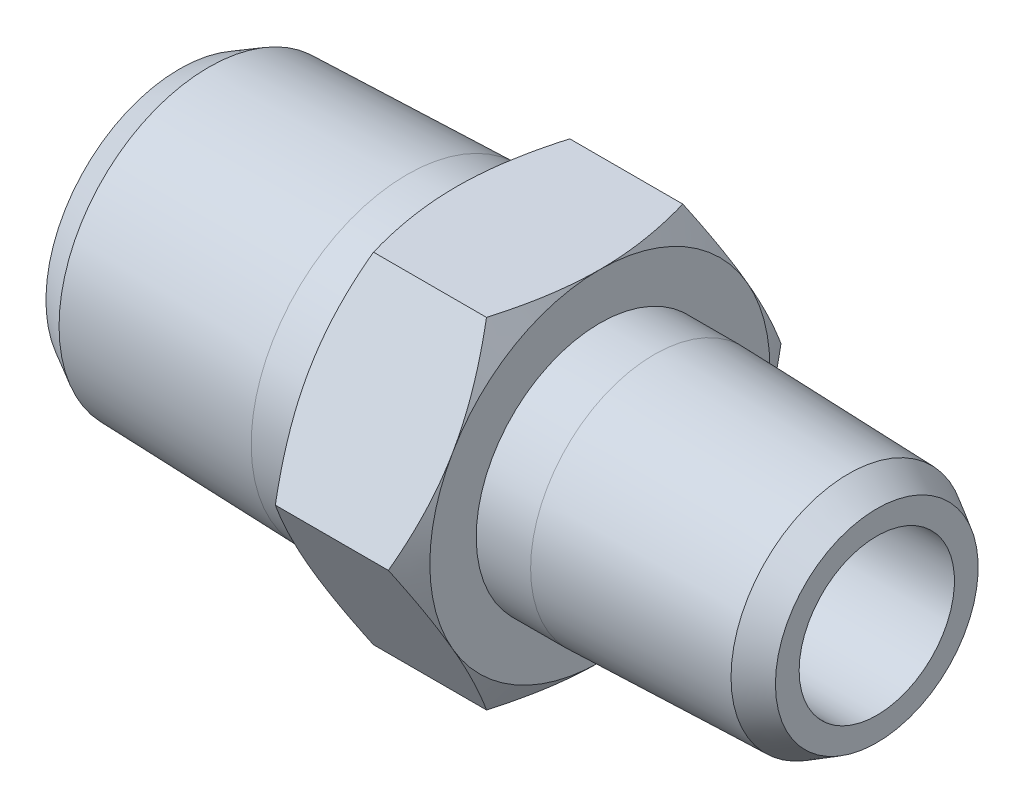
ISO-10303-21;
HEADER;
FILE_DESCRIPTION(('STEP AP214'),'2;1');
FILE_NAME('part.step','',(''),(''),'','','');
FILE_SCHEMA(('AUTOMOTIVE_DESIGN { 1 0 10303 214 1 1 1 1 }'));
ENDSEC;
DATA;
#1=APPLICATION_CONTEXT('core data for automotive mechanical design processes');
#2=APPLICATION_PROTOCOL_DEFINITION('international standard','automotive_design',2000,#1);
#3=PRODUCT_CONTEXT('',#1,'mechanical');
#4=PRODUCT('Part','Part','',(#3));
#5=PRODUCT_RELATED_PRODUCT_CATEGORY('part','',(#4));
#6=PRODUCT_DEFINITION_FORMATION('','',#4);
#7=PRODUCT_DEFINITION_CONTEXT('part definition',#1,'design');
#8=PRODUCT_DEFINITION('design','',#6,#7);
#9=PRODUCT_DEFINITION_SHAPE('','',#8);
#10=(LENGTH_UNIT() NAMED_UNIT(*) SI_UNIT(.MILLI.,.METRE.));
#11=(NAMED_UNIT(*) PLANE_ANGLE_UNIT() SI_UNIT($,.RADIAN.));
#12=(NAMED_UNIT(*) SI_UNIT($,.STERADIAN.) SOLID_ANGLE_UNIT());
#13=UNCERTAINTY_MEASURE_WITH_UNIT(LENGTH_MEASURE(1.E-05),#10,'distance_accuracy_value','');
#14=(GEOMETRIC_REPRESENTATION_CONTEXT(3) GLOBAL_UNCERTAINTY_ASSIGNED_CONTEXT((#13)) GLOBAL_UNIT_ASSIGNED_CONTEXT((#10,
#11,#12)) REPRESENTATION_CONTEXT('',''));
#15=CARTESIAN_POINT('',(0.,0.,0.));
#16=DIRECTION('',(0.,0.,1.));
#17=DIRECTION('',(1.,0.,0.));
#18=AXIS2_PLACEMENT_3D('',#15,#16,#17);
#19=CARTESIAN_POINT('',(6.58147714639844,0.,0.));
#20=DIRECTION('',(-1.,0.,0.));
#21=DIRECTION('',(0.,0.,1.));
#22=AXIS2_PLACEMENT_3D('',#19,#20,#21);
#23=CONICAL_SURFACE('',#22,10.0900834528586,1.04719755);
#24=CARTESIAN_POINT('',(7.36600000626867,0.,0.));
#25=DIRECTION('',(-1.,0.,0.));
#26=DIRECTION('',(0.,0.,1.));
#27=AXIS2_PLACEMENT_3D('',#24,#25,#26);
#28=CIRCLE('',#27,8.73125000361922);
#29=CARTESIAN_POINT('',(7.36600000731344,-4.3656250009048,-7.56148430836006));
#30=VERTEX_POINT('',#29);
#31=CARTESIAN_POINT('',(7.36600000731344,4.3656250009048,-7.56148430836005));
#32=VERTEX_POINT('',#31);
#33=EDGE_CURVE('E110',#30,#32,#28,.F.);
#34=ORIENTED_EDGE('',*,*,#33,.F.);
#35=CARTESIAN_POINT('',(6.58615620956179,1.83149545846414E-09,-10.0819790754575));
#36=CARTESIAN_POINT('',(6.70463926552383,-0.355360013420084,-9.87681187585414));
#37=CARTESIAN_POINT('',(6.8131904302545,-0.713565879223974,-9.67000162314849));
#38=CARTESIAN_POINT('',(7.00461845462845,-1.43313515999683,-9.2545581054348));
#39=CARTESIAN_POINT('',(7.08762226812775,-1.79447347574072,-9.04593933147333));
#40=CARTESIAN_POINT('',(7.18953685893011,-2.33989110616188,-8.73104231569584));
#41=CARTESIAN_POINT('',(7.21975557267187,-2.52238596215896,-8.62567886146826));
#42=CARTESIAN_POINT('',(7.27206479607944,-2.88824935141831,-8.41444753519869));
#43=CARTESIAN_POINT('',(7.29415551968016,-3.07161786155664,-8.30857967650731));
#44=CARTESIAN_POINT('',(7.32982062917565,-3.43990681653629,-8.09594794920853));
#45=CARTESIAN_POINT('',(7.34335170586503,-3.62483043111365,-7.9891822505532));
#46=CARTESIAN_POINT('',(7.36146012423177,-3.99504134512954,-7.77544087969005));
#47=CARTESIAN_POINT('',(7.36603569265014,-4.18032870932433,-7.66846517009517));
#48=CARTESIAN_POINT('',(7.36600000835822,-4.3656249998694,-7.56148430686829));
#49=B_SPLINE_CURVE_WITH_KNOTS('',3,(#35,#36,#37,#38,#39,#40,#41,#42,#43,#44,#45,#46,#47,#48),
.UNSPECIFIED.,.F.,.F.,(4,2,2,2,2,2,4),(0.,1.28181151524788,2.55714639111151,3.19565058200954,
3.83413796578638,4.47583059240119,5.11765026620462),.UNSPECIFIED.);
#50=CARTESIAN_POINT('',(6.5861562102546,0.,-10.0819790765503));
#51=VERTEX_POINT('',#50);
#52=EDGE_CURVE('E123',#51,#30,#49,.T.);
#53=ORIENTED_EDGE('',*,*,#52,.F.);
#54=CARTESIAN_POINT('',(7.36600000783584,4.3656249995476,-7.5614843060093));
#55=CARTESIAN_POINT('',(7.3660356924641,4.18032870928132,-7.668465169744));
#56=CARTESIAN_POINT('',(7.36146012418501,3.99504134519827,-7.77544087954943));
#57=CARTESIAN_POINT('',(7.34335170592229,3.62483043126,-7.98918225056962));
#58=CARTESIAN_POINT('',(7.32982062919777,3.43990681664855,-8.09594794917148));
#59=CARTESIAN_POINT('',(7.29415551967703,3.07161786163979,-8.30857967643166));
#60=CARTESIAN_POINT('',(7.272064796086,2.88824935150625,-8.41444753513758));
#61=CARTESIAN_POINT('',(7.21975557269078,2.52238596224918,-8.62567886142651));
#62=CARTESIAN_POINT('',(7.18953685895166,2.33989110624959,-8.73104231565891));
#63=CARTESIAN_POINT('',(7.0876222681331,1.79447347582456,-9.04593933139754));
#64=CARTESIAN_POINT('',(7.00461845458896,1.43313516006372,-9.25455810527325));
#65=CARTESIAN_POINT('',(6.8131904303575,0.713565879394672,-9.67000162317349));
#66=CARTESIAN_POINT('',(6.70463926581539,0.355360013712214,-9.87681187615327));
#67=CARTESIAN_POINT('',(6.58615621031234,-1.25830554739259E-09,-10.0819790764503));
#68=B_SPLINE_CURVE_WITH_KNOTS('',3,(#54,#55,#56,#57,#58,#59,#60,#61,#62,#63,#64,#65,#66,#67),
.UNSPECIFIED.,.F.,.F.,(4,2,2,2,2,2,4),(0.,0.641819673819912,1.28351230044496,1.92199968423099,
2.5605038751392,3.83583875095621,5.11765026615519),.UNSPECIFIED.);
#69=EDGE_CURVE('E132',#32,#51,#68,.T.);
#70=ORIENTED_EDGE('',*,*,#69,.F.);
#71=EDGE_LOOP('',(#34,#53,#70));
#72=FACE_BOUND('',#71,.T.);
#73=ADVANCED_FACE('F17',(#72),#23,.T.);
#74=CARTESIAN_POINT('',(6.58147714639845,0.,0.));
#75=DIRECTION('',(-1.,0.,0.));
#76=DIRECTION('',(0.,0.,1.));
#77=AXIS2_PLACEMENT_3D('',#74,#75,#76);
#78=CONICAL_SURFACE('',#77,10.0900834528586,1.04719755);
#79=CARTESIAN_POINT('',(7.36600000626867,0.,0.));
#80=DIRECTION('',(-1.,0.,0.));
#81=DIRECTION('',(0.,0.,1.));
#82=AXIS2_PLACEMENT_3D('',#79,#80,#81);
#83=CIRCLE('',#82,8.73125000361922);
#84=CARTESIAN_POINT('',(7.36600000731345,8.73125000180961,0.));
#85=VERTEX_POINT('',#84);
#86=EDGE_CURVE('E134',#32,#85,#83,.F.);
#87=ORIENTED_EDGE('',*,*,#86,.F.);
#88=CARTESIAN_POINT('',(6.58615620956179,8.73125000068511,-5.04098953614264));
#89=CARTESIAN_POINT('',(6.70463926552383,8.37588998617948,-5.24615673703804));
#90=CARTESIAN_POINT('',(6.81319043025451,8.01768412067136,-5.45296699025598));
#91=CARTESIAN_POINT('',(7.00461845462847,7.29811484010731,-5.86841050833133));
#92=CARTESIAN_POINT('',(7.08762226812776,6.93677652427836,-6.07702928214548));
#93=CARTESIAN_POINT('',(7.18953685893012,6.39135889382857,-6.39192629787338));
#94=CARTESIAN_POINT('',(7.21975557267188,6.20886403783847,-6.49728975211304));
#95=CARTESIAN_POINT('',(7.27206479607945,5.84300064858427,-6.70852107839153));
#96=CARTESIAN_POINT('',(7.29415551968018,5.6596321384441,-6.81438893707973));
#97=CARTESIAN_POINT('',(7.32982062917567,5.29134318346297,-7.02702066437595));
#98=CARTESIAN_POINT('',(7.34335170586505,5.10641956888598,-7.13378636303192));
#99=CARTESIAN_POINT('',(7.36146012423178,4.73620865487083,-7.34752773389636));
#100=CARTESIAN_POINT('',(7.36603569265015,4.55092129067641,-7.45450344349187));
#101=CARTESIAN_POINT('',(7.36600000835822,4.3656250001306,-7.56148430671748));
#102=B_SPLINE_CURVE_WITH_KNOTS('',3,(#88,#89,#90,#91,#92,#93,#94,#95,#96,#97,#98,#99,#100,#101),
.UNSPECIFIED.,.F.,.F.,(4,2,2,2,2,2,4),(0.,1.28181151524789,2.55714639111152,3.19565058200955,
3.83413796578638,4.47583059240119,5.11765026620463),.UNSPECIFIED.);
#103=CARTESIAN_POINT('',(6.5861562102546,8.73125000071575,-5.04098953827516));
#104=VERTEX_POINT('',#103);
#105=EDGE_CURVE('E122',#104,#32,#102,.T.);
#106=ORIENTED_EDGE('',*,*,#105,.F.);
#107=CARTESIAN_POINT('',(7.36600000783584,8.7312499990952,0.));
#108=CARTESIAN_POINT('',(7.36603569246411,8.73124999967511,-0.213961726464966));
#109=CARTESIAN_POINT('',(7.36146012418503,8.73124999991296,-0.427913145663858));
#110=CARTESIAN_POINT('',(7.34335170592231,8.73125000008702,-0.85539588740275));
#111=CARTESIAN_POINT('',(7.32982062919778,8.73125000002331,-1.06892728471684));
#112=CARTESIAN_POINT('',(7.29415551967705,8.73124999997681,-1.49419073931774));
#113=CARTESIAN_POINT('',(7.27206479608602,8.73124999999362,-1.70592645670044));
#114=CARTESIAN_POINT('',(7.21975557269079,8.73125000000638,-2.12838910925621));
#115=CARTESIAN_POINT('',(7.18953685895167,8.73125000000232,-2.33911601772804));
#116=CARTESIAN_POINT('',(7.08762226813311,8.73124999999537,-2.96891004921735));
#117=CARTESIAN_POINT('',(7.00461845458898,8.73124999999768,-3.38614759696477));
#118=CARTESIAN_POINT('',(6.81319043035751,8.73125000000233,-4.21703463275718));
#119=CARTESIAN_POINT('',(6.70463926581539,8.73125000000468,-4.63065513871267));
#120=CARTESIAN_POINT('',(6.58615621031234,8.73125,-5.04098953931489));
#121=B_SPLINE_CURVE_WITH_KNOTS('',3,(#107,#108,#109,#110,#111,#112,#113,#114,#115,#116,#117,
#118,#119,#120),.UNSPECIFIED.,.F.,.F.,(4,2,2,2,2,2,4),(0.,0.641819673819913,1.28351230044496,
1.92199968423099,2.5605038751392,3.83583875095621,5.1176502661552),.UNSPECIFIED.);
#122=EDGE_CURVE('E427',#85,#104,#121,.T.);
#123=ORIENTED_EDGE('',*,*,#122,.F.);
#124=EDGE_LOOP('',(#87,#106,#123));
#125=FACE_BOUND('',#124,.T.);
#126=ADVANCED_FACE('F158',(#125),#78,.T.);
#127=CARTESIAN_POINT('',(6.58147714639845,0.,0.));
#128=DIRECTION('',(-1.,0.,0.));
#129=DIRECTION('',(0.,0.,1.));
#130=AXIS2_PLACEMENT_3D('',#127,#128,#129);
#131=CONICAL_SURFACE('',#130,10.0900834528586,1.04719755);
#132=CARTESIAN_POINT('',(7.36600000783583,4.3656249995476,7.56148430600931));
#133=CARTESIAN_POINT('',(7.3660356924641,4.55092129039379,7.45450344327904));
#134=CARTESIAN_POINT('',(7.36146012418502,4.73620865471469,7.34752773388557));
#135=CARTESIAN_POINT('',(7.34335170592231,5.10641956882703,7.13378636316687));
#136=CARTESIAN_POINT('',(7.32982062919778,5.29134318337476,7.02702066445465));
#137=CARTESIAN_POINT('',(7.29415551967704,5.65963213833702,6.81438893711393));
#138=CARTESIAN_POINT('',(7.27206479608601,5.84300064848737,6.70852107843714));
#139=CARTESIAN_POINT('',(7.21975557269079,6.2088640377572,6.4972897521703));
#140=CARTESIAN_POINT('',(7.18953685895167,6.39135889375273,6.39192629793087));
#141=CARTESIAN_POINT('',(7.08762226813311,6.93677652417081,6.0770292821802));
#142=CARTESIAN_POINT('',(7.00461845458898,7.29811483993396,5.86841050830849));
#143=CARTESIAN_POINT('',(6.81319043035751,8.01768412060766,5.45296699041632));
#144=CARTESIAN_POINT('',(6.70463926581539,8.37588998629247,5.2461567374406));
#145=CARTESIAN_POINT('',(6.58615621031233,8.73125000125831,5.04098953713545));
#146=B_SPLINE_CURVE_WITH_KNOTS('',3,(#132,#133,#134,#135,#136,#137,#138,#139,#140,#141,#142,
#143,#144,#145),.UNSPECIFIED.,.F.,.F.,(4,2,2,2,2,2,4),(0.,0.641819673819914,1.28351230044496,
1.92199968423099,2.5605038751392,3.83583875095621,5.1176502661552),.UNSPECIFIED.);
#147=CARTESIAN_POINT('',(7.36600000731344,4.3656250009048,7.56148430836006));
#148=VERTEX_POINT('',#147);
#149=CARTESIAN_POINT('',(6.5861562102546,8.73125000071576,5.04098953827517));
#150=VERTEX_POINT('',#149);
#151=EDGE_CURVE('E424',#148,#150,#146,.T.);
#152=ORIENTED_EDGE('',*,*,#151,.F.);
#153=CARTESIAN_POINT('',(7.36600000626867,0.,0.));
#154=DIRECTION('',(-1.,0.,0.));
#155=DIRECTION('',(0.,0.,1.));
#156=AXIS2_PLACEMENT_3D('',#153,#154,#155);
#157=CIRCLE('',#156,8.73125000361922);
#158=EDGE_CURVE('E135',#85,#148,#157,.F.);
#159=ORIENTED_EDGE('',*,*,#158,.F.);
#160=CARTESIAN_POINT('',(6.58615620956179,8.73124999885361,5.04098953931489));
#161=CARTESIAN_POINT('',(6.70463926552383,8.73124999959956,4.63065513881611));
#162=CARTESIAN_POINT('',(6.81319043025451,8.73124999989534,4.21703463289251));
#163=CARTESIAN_POINT('',(7.00461845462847,8.73125000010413,3.38614759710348));
#164=CARTESIAN_POINT('',(7.08762226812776,8.73125000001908,2.96891004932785));
#165=CARTESIAN_POINT('',(7.18953685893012,8.73124999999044,2.33911601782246));
#166=CARTESIAN_POINT('',(7.21975557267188,8.73124999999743,2.12838910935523));
#167=CARTESIAN_POINT('',(7.27206479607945,8.73125000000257,1.70592645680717));
#168=CARTESIAN_POINT('',(7.29415551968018,8.73125000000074,1.49419073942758));
#169=CARTESIAN_POINT('',(7.32982062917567,8.73124999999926,1.06892728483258));
#170=CARTESIAN_POINT('',(7.34335170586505,8.73124999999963,0.855395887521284));
#171=CARTESIAN_POINT('',(7.36146012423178,8.73125000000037,0.427913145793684));
#172=CARTESIAN_POINT('',(7.36603569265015,8.73125000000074,0.213961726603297));
#173=CARTESIAN_POINT('',(7.36600000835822,8.73125,1.50800964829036E-10));
#174=B_SPLINE_CURVE_WITH_KNOTS('',3,(#160,#161,#162,#163,#164,#165,#166,#167,#168,#169,#170,
#171,#172,#173),.UNSPECIFIED.,.F.,.F.,(4,2,2,2,2,2,4),(0.,1.28181151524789,2.55714639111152,
3.19565058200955,3.83413796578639,4.4758305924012,5.11765026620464),.UNSPECIFIED.);
#175=EDGE_CURVE('E168',#150,#85,#174,.T.);
#176=ORIENTED_EDGE('',*,*,#175,.F.);
#177=EDGE_LOOP('',(#152,#159,#176));
#178=FACE_BOUND('',#177,.T.);
#179=ADVANCED_FACE('F633',(#178),#131,.T.);
#180=CARTESIAN_POINT('',(6.58147714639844,0.,0.));
#181=DIRECTION('',(-1.,0.,0.));
#182=DIRECTION('',(0.,0.,1.));
#183=AXIS2_PLACEMENT_3D('',#180,#181,#182);
#184=CONICAL_SURFACE('',#183,10.0900834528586,1.04719755);
#185=CARTESIAN_POINT('',(7.36600000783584,-4.3656249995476,7.5614843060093));
#186=CARTESIAN_POINT('',(7.3660356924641,-4.18032870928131,7.668465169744));
#187=CARTESIAN_POINT('',(7.36146012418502,-3.99504134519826,7.77544087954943));
#188=CARTESIAN_POINT('',(7.3433517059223,-3.62483043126,7.98918225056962));
#189=CARTESIAN_POINT('',(7.32982062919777,-3.43990681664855,8.09594794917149));
#190=CARTESIAN_POINT('',(7.29415551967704,-3.07161786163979,8.30857967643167));
#191=CARTESIAN_POINT('',(7.27206479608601,-2.88824935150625,8.41444753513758));
#192=CARTESIAN_POINT('',(7.21975557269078,-2.52238596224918,8.62567886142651));
#193=CARTESIAN_POINT('',(7.18953685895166,-2.33989110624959,8.73104231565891));
#194=CARTESIAN_POINT('',(7.0876222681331,-1.79447347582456,9.04593933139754));
#195=CARTESIAN_POINT('',(7.00461845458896,-1.43313516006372,9.25455810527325));
#196=CARTESIAN_POINT('',(6.8131904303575,-0.713565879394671,9.67000162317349));
#197=CARTESIAN_POINT('',(6.70463926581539,-0.355360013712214,9.87681187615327));
#198=CARTESIAN_POINT('',(6.58615621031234,1.25830591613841E-09,10.0819790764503));
#199=B_SPLINE_CURVE_WITH_KNOTS('',3,(#185,#186,#187,#188,#189,#190,#191,#192,#193,#194,#195,
#196,#197,#198),.UNSPECIFIED.,.F.,.F.,(4,2,2,2,2,2,4),(0.,0.641819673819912,1.28351230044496,
1.92199968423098,2.56050387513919,3.8358387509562,5.11765026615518),.UNSPECIFIED.);
#200=CARTESIAN_POINT('',(7.36600000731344,-4.3656250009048,7.56148430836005));
#201=VERTEX_POINT('',#200);
#202=CARTESIAN_POINT('',(6.5861562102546,0.,10.0819790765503));
#203=VERTEX_POINT('',#202);
#204=EDGE_CURVE('E270',#201,#203,#199,.T.);
#205=ORIENTED_EDGE('',*,*,#204,.F.);
#206=CARTESIAN_POINT('',(7.36600000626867,0.,0.));
#207=DIRECTION('',(-1.,0.,0.));
#208=DIRECTION('',(0.,0.,1.));
#209=AXIS2_PLACEMENT_3D('',#206,#207,#208);
#210=CIRCLE('',#209,8.73125000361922);
#211=EDGE_CURVE('E139',#148,#201,#210,.F.);
#212=ORIENTED_EDGE('',*,*,#211,.F.);
#213=CARTESIAN_POINT('',(6.58615620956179,-1.83149473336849E-09,10.0819790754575));
#214=CARTESIAN_POINT('',(6.70463926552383,0.355360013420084,9.87681187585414));
#215=CARTESIAN_POINT('',(6.8131904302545,0.713565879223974,9.67000162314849));
#216=CARTESIAN_POINT('',(7.00461845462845,1.43313515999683,9.2545581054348));
#217=CARTESIAN_POINT('',(7.08762226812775,1.79447347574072,9.04593933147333));
#218=CARTESIAN_POINT('',(7.18953685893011,2.33989110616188,8.73104231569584));
#219=CARTESIAN_POINT('',(7.21975557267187,2.52238596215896,8.62567886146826));
#220=CARTESIAN_POINT('',(7.27206479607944,2.88824935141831,8.41444753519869));
#221=CARTESIAN_POINT('',(7.29415551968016,3.07161786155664,8.30857967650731));
#222=CARTESIAN_POINT('',(7.32982062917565,3.43990681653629,8.09594794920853));
#223=CARTESIAN_POINT('',(7.34335170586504,3.62483043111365,7.9891822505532));
#224=CARTESIAN_POINT('',(7.36146012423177,3.99504134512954,7.77544087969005));
#225=CARTESIAN_POINT('',(7.36603569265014,4.18032870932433,7.66846517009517));
#226=CARTESIAN_POINT('',(7.36600000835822,4.3656249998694,7.56148430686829));
#227=B_SPLINE_CURVE_WITH_KNOTS('',3,(#213,#214,#215,#216,#217,#218,#219,#220,#221,#222,#223,
#224,#225,#226),.UNSPECIFIED.,.F.,.F.,(4,2,2,2,2,2,4),(0.,1.28181151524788,2.55714639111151,
3.19565058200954,3.83413796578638,4.47583059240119,5.11765026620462),.UNSPECIFIED.);
#228=EDGE_CURVE('E423',#203,#148,#227,.T.);
#229=ORIENTED_EDGE('',*,*,#228,.F.);
#230=EDGE_LOOP('',(#205,#212,#229));
#231=FACE_BOUND('',#230,.T.);
#232=ADVANCED_FACE('F259',(#231),#184,.T.);
#233=CARTESIAN_POINT('',(6.58147714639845,0.,0.));
#234=DIRECTION('',(-1.,0.,0.));
#235=DIRECTION('',(0.,0.,1.));
#236=AXIS2_PLACEMENT_3D('',#233,#234,#235);
#237=CONICAL_SURFACE('',#236,10.0900834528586,1.04719755);
#238=CARTESIAN_POINT('',(7.36600000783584,-8.7312499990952,0.));
#239=CARTESIAN_POINT('',(7.36603569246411,-8.73124999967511,0.213961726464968));
#240=CARTESIAN_POINT('',(7.36146012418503,-8.73124999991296,0.42791314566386));
#241=CARTESIAN_POINT('',(7.34335170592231,-8.73125000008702,0.855395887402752));
#242=CARTESIAN_POINT('',(7.32982062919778,-8.73125000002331,1.06892728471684));
#243=CARTESIAN_POINT('',(7.29415551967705,-8.73124999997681,1.49419073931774));
#244=CARTESIAN_POINT('',(7.27206479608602,-8.73124999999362,1.70592645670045));
#245=CARTESIAN_POINT('',(7.21975557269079,-8.73125000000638,2.12838910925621));
#246=CARTESIAN_POINT('',(7.18953685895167,-8.73125000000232,2.33911601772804));
#247=CARTESIAN_POINT('',(7.08762226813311,-8.73124999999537,2.96891004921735));
#248=CARTESIAN_POINT('',(7.00461845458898,-8.73124999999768,3.38614759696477));
#249=CARTESIAN_POINT('',(6.81319043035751,-8.73125000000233,4.21703463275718));
#250=CARTESIAN_POINT('',(6.70463926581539,-8.73125000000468,4.63065513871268));
#251=CARTESIAN_POINT('',(6.58615621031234,-8.73125,5.04098953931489));
#252=B_SPLINE_CURVE_WITH_KNOTS('',3,(#238,#239,#240,#241,#242,#243,#244,#245,#246,#247,#248,
#249,#250,#251),.UNSPECIFIED.,.F.,.F.,(4,2,2,2,2,2,4),(0.,0.641819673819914,1.28351230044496,
1.92199968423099,2.5605038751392,3.83583875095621,5.1176502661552),.UNSPECIFIED.);
#253=CARTESIAN_POINT('',(7.36600000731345,-8.73125000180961,0.));
#254=VERTEX_POINT('',#253);
#255=CARTESIAN_POINT('',(6.5861562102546,-8.73125000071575,5.04098953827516));
#256=VERTEX_POINT('',#255);
#257=EDGE_CURVE('E243',#254,#256,#252,.T.);
#258=ORIENTED_EDGE('',*,*,#257,.F.);
#259=CARTESIAN_POINT('',(7.36600000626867,0.,0.));
#260=DIRECTION('',(-1.,0.,0.));
#261=DIRECTION('',(0.,0.,1.));
#262=AXIS2_PLACEMENT_3D('',#259,#260,#261);
#263=CIRCLE('',#262,8.73125000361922);
#264=EDGE_CURVE('E104',#201,#254,#263,.F.);
#265=ORIENTED_EDGE('',*,*,#264,.F.);
#266=CARTESIAN_POINT('',(6.58615620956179,-8.73125000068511,5.04098953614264));
#267=CARTESIAN_POINT('',(6.70463926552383,-8.37588998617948,5.24615673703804));
#268=CARTESIAN_POINT('',(6.81319043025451,-8.01768412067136,5.45296699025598));
#269=CARTESIAN_POINT('',(7.00461845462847,-7.29811484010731,5.86841050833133));
#270=CARTESIAN_POINT('',(7.08762226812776,-6.93677652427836,6.07702928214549));
#271=CARTESIAN_POINT('',(7.18953685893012,-6.39135889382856,6.39192629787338));
#272=CARTESIAN_POINT('',(7.21975557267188,-6.20886403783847,6.49728975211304));
#273=CARTESIAN_POINT('',(7.27206479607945,-5.84300064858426,6.70852107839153));
#274=CARTESIAN_POINT('',(7.29415551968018,-5.6596321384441,6.81438893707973));
#275=CARTESIAN_POINT('',(7.32982062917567,-5.29134318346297,7.02702066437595));
#276=CARTESIAN_POINT('',(7.34335170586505,-5.10641956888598,7.13378636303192));
#277=CARTESIAN_POINT('',(7.36146012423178,-4.73620865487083,7.34752773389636));
#278=CARTESIAN_POINT('',(7.36603569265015,-4.5509212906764,7.45450344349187));
#279=CARTESIAN_POINT('',(7.36600000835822,-4.36562500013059,7.56148430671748));
#280=B_SPLINE_CURVE_WITH_KNOTS('',3,(#266,#267,#268,#269,#270,#271,#272,#273,#274,#275,#276,
#277,#278,#279),.UNSPECIFIED.,.F.,.F.,(4,2,2,2,2,2,4),(0.,1.28181151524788,2.55714639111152,
3.19565058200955,3.83413796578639,4.4758305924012,5.11765026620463),.UNSPECIFIED.);
#281=EDGE_CURVE('E263',#256,#201,#280,.T.);
#282=ORIENTED_EDGE('',*,*,#281,.F.);
#283=EDGE_LOOP('',(#258,#265,#282));
#284=FACE_BOUND('',#283,.T.);
#285=ADVANCED_FACE('F254',(#284),#237,.T.);
#286=CARTESIAN_POINT('',(6.58147714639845,0.,0.));
#287=DIRECTION('',(-1.,0.,0.));
#288=DIRECTION('',(0.,0.,1.));
#289=AXIS2_PLACEMENT_3D('',#286,#287,#288);
#290=CONICAL_SURFACE('',#289,10.0900834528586,1.04719755);
#291=CARTESIAN_POINT('',(7.36600000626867,0.,0.));
#292=DIRECTION('',(-1.,0.,0.));
#293=DIRECTION('',(0.,0.,1.));
#294=AXIS2_PLACEMENT_3D('',#291,#292,#293);
#295=CIRCLE('',#294,8.73125000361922);
#296=EDGE_CURVE('E21',#254,#30,#295,.F.);
#297=ORIENTED_EDGE('',*,*,#296,.F.);
#298=CARTESIAN_POINT('',(6.58615620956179,-8.7312499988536,-5.04098953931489));
#299=CARTESIAN_POINT('',(6.70463926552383,-8.73124999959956,-4.63065513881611));
#300=CARTESIAN_POINT('',(6.81319043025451,-8.73124999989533,-4.21703463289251));
#301=CARTESIAN_POINT('',(7.00461845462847,-8.73125000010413,-3.38614759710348));
#302=CARTESIAN_POINT('',(7.08762226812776,-8.73125000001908,-2.96891004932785));
#303=CARTESIAN_POINT('',(7.18953685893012,-8.73124999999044,-2.33911601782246));
#304=CARTESIAN_POINT('',(7.21975557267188,-8.73124999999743,-2.12838910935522));
#305=CARTESIAN_POINT('',(7.27206479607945,-8.73125000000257,-1.70592645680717));
#306=CARTESIAN_POINT('',(7.29415551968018,-8.73125000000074,-1.49419073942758));
#307=CARTESIAN_POINT('',(7.32982062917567,-8.73124999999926,-1.06892728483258));
#308=CARTESIAN_POINT('',(7.34335170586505,-8.73124999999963,-0.855395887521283));
#309=CARTESIAN_POINT('',(7.36146012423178,-8.73125000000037,-0.427913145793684));
#310=CARTESIAN_POINT('',(7.36603569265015,-8.73125000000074,-0.213961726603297));
#311=CARTESIAN_POINT('',(7.36600000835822,-8.73125,-1.50799745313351E-10));
#312=B_SPLINE_CURVE_WITH_KNOTS('',3,(#298,#299,#300,#301,#302,#303,#304,#305,#306,#307,#308,
#309,#310,#311),.UNSPECIFIED.,.F.,.F.,(4,2,2,2,2,2,4),(0.,1.28181151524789,2.55714639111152,
3.19565058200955,3.83413796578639,4.4758305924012,5.11765026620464),.UNSPECIFIED.);
#313=CARTESIAN_POINT('',(6.58615621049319,-8.73125000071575,-5.04098953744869));
#314=VERTEX_POINT('',#313);
#315=EDGE_CURVE('E118',#314,#254,#312,.T.);
#316=ORIENTED_EDGE('',*,*,#315,.F.);
#317=CARTESIAN_POINT('',(7.36600000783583,-4.3656249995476,-7.5614843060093));
#318=CARTESIAN_POINT('',(7.3660356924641,-4.55092129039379,-7.45450344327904));
#319=CARTESIAN_POINT('',(7.36146012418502,-4.73620865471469,-7.34752773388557));
#320=CARTESIAN_POINT('',(7.34335170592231,-5.10641956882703,-7.13378636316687));
#321=CARTESIAN_POINT('',(7.32982062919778,-5.29134318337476,-7.02702066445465));
#322=CARTESIAN_POINT('',(7.29415551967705,-5.65963213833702,-6.81438893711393));
#323=CARTESIAN_POINT('',(7.27206479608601,-5.84300064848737,-6.70852107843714));
#324=CARTESIAN_POINT('',(7.21975557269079,-6.2088640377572,-6.4972897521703));
#325=CARTESIAN_POINT('',(7.18953685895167,-6.39135889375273,-6.39192629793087));
#326=CARTESIAN_POINT('',(7.08762226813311,-6.93677652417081,-6.0770292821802));
#327=CARTESIAN_POINT('',(7.00461845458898,-7.29811483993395,-5.86841050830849));
#328=CARTESIAN_POINT('',(6.81319043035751,-8.01768412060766,-5.45296699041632));
#329=CARTESIAN_POINT('',(6.70463926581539,-8.37588998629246,-5.2461567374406));
#330=CARTESIAN_POINT('',(6.58615621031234,-8.7312500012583,-5.04098953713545));
#331=B_SPLINE_CURVE_WITH_KNOTS('',3,(#317,#318,#319,#320,#321,#322,#323,#324,#325,#326,#327,
#328,#329,#330),.UNSPECIFIED.,.F.,.F.,(4,2,2,2,2,2,4),(0.,0.641819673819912,1.28351230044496,
1.92199968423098,2.56050387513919,3.8358387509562,5.11765026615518),.UNSPECIFIED.);
#332=EDGE_CURVE('E114',#30,#314,#331,.T.);
#333=ORIENTED_EDGE('',*,*,#332,.F.);
#334=EDGE_LOOP('',(#297,#316,#333));
#335=FACE_BOUND('',#334,.T.);
#336=ADVANCED_FACE('F116',(#335),#290,.T.);
#337=CARTESIAN_POINT('',(7.366,0.,0.));
#338=DIRECTION('',(1.,0.,0.));
#339=DIRECTION('',(0.,0.,-1.));
#340=AXIS2_PLACEMENT_3D('',#337,#338,#339);
#341=PLANE('',#340);
#342=CARTESIAN_POINT('',(7.366,0.,0.));
#343=DIRECTION('',(1.,0.,0.));
#344=DIRECTION('',(0.,1.,0.));
#345=AXIS2_PLACEMENT_3D('',#342,#343,#344);
#346=CIRCLE('',#345,6.35);
#347=CARTESIAN_POINT('',(7.366,6.35,0.));
#348=VERTEX_POINT('',#347);
#349=EDGE_CURVE('E235',#348,#348,#346,.T.);
#350=ORIENTED_EDGE('',*,*,#349,.F.);
#351=EDGE_LOOP('',(#350));
#352=FACE_BOUND('',#351,.T.);
#353=ORIENTED_EDGE('',*,*,#211,.T.);
#354=ORIENTED_EDGE('',*,*,#264,.T.);
#355=ORIENTED_EDGE('',*,*,#296,.T.);
#356=ORIENTED_EDGE('',*,*,#33,.T.);
#357=ORIENTED_EDGE('',*,*,#86,.T.);
#358=ORIENTED_EDGE('',*,*,#158,.T.);
#359=EDGE_LOOP('',(#353,#354,#355,#356,#357,#358));
#360=FACE_BOUND('',#359,.T.);
#361=ADVANCED_FACE('F108',(#352,#360),#341,.T.);
#362=CARTESIAN_POINT('',(0.,0.,-10.0819790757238));
#363=DIRECTION('',(0.,-0.5,-0.866025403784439));
#364=DIRECTION('',(0.,0.866025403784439,-0.5));
#365=AXIS2_PLACEMENT_3D('',#362,#363,#364);
#366=PLANE('',#365);
#367=CARTESIAN_POINT('',(0.779843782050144,-2.16542177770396E-08,-10.0819790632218));
#368=CARTESIAN_POINT('',(0.661360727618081,-0.355360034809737,-9.87681186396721));
#369=CARTESIAN_POINT('',(0.552809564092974,-0.713565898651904,-9.67000161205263));
#370=CARTESIAN_POINT('',(0.361381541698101,-1.43313517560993,-9.25455809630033));
#371=CARTESIAN_POINT('',(0.278377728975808,-1.79447348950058,-9.04593932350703));
#372=CARTESIAN_POINT('',(0.176463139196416,-2.33989111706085,-8.73104230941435));
#373=CARTESIAN_POINT('',(0.146244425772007,-2.52238597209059,-8.6256788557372));
#374=CARTESIAN_POINT('',(0.0939352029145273,-2.8882493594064,-8.41444753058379));
#375=CARTESIAN_POINT('',(0.0718444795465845,-3.07161786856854,-8.30857967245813));
#376=CARTESIAN_POINT('',(0.0361793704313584,-3.4399068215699,-8.09594794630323));
#377=CARTESIAN_POINT('',(0.0226482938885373,-3.62483043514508,-7.98918224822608));
#378=CARTESIAN_POINT('',(0.00453987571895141,-3.99504134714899,-7.77544087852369));
#379=CARTESIAN_POINT('',(-3.56926489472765E-05,-4.18032871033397,-7.6684651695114));
#380=CARTESIAN_POINT('',(-8.35823606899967E-09,-4.3656249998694,-7.56148430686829));
#381=B_SPLINE_CURVE_WITH_KNOTS('',3,(#367,#368,#369,#370,#371,#372,#373,#374,#375,#376,#377,
#378,#379,#380),.UNSPECIFIED.,.F.,.F.,(4,2,2,2,2,2,4),(0.,1.28181150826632,2.55714637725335,
3.19565056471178,3.83413794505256,4.47583056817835,5.1176502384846),.UNSPECIFIED.);
#382=CARTESIAN_POINT('',(0.779843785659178,1.08271018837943E-08,-10.0819790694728));
#383=VERTEX_POINT('',#382);
#384=CARTESIAN_POINT('',(-7.31345778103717E-09,-4.3656250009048,-7.56148430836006));
#385=VERTEX_POINT('',#384);
#386=EDGE_CURVE('E204',#383,#385,#381,.T.);
#387=ORIENTED_EDGE('',*,*,#386,.F.);
#388=DIRECTION('',(1.,0.,0.));
#389=VECTOR('',#388,1.);
#390=CARTESIAN_POINT('',(0.,0.,-10.0819790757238));
#391=LINE('',#390,#389);
#392=EDGE_CURVE('E129',#51,#383,#391,.F.);
#393=ORIENTED_EDGE('',*,*,#392,.F.);
#394=ORIENTED_EDGE('',*,*,#52,.T.);
#395=ORIENTED_EDGE('',*,*,#332,.T.);
#396=DIRECTION('',(1.,0.,0.));
#397=VECTOR('',#396,1.);
#398=CARTESIAN_POINT('',(0.,-8.73125,-5.04098953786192));
#399=LINE('',#398,#397);
#400=CARTESIAN_POINT('',(0.779843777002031,-8.73124996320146,-5.04098955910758));
#401=VERTEX_POINT('',#400);
#402=EDGE_CURVE('E242',#401,#314,#399,.T.);
#403=ORIENTED_EDGE('',*,*,#402,.F.);
#404=CARTESIAN_POINT('',(-7.8358457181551E-09,-4.3656249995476,-7.5614843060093));
#405=CARTESIAN_POINT('',(-3.56924616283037E-05,-4.55092128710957,-7.45450344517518));
#406=CARTESIAN_POINT('',(0.00453987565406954,-4.73620864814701,-7.34752773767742));
#407=CARTESIAN_POINT('',(0.0226482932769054,-5.10641955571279,-7.13378637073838));
#408=CARTESIAN_POINT('',(0.0361793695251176,-5.29134316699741,-7.02702067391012));
#409=CARTESIAN_POINT('',(0.0718444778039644,-5.65963211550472,-6.81438895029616));
#410=CARTESIAN_POINT('',(0.0939352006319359,-5.84300062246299,-6.70852109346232));
#411=CARTESIAN_POINT('',(0.146244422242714,-6.20886400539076,-6.49728977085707));
#412=CARTESIAN_POINT('',(0.176463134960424,-6.39135885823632,-6.39192631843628));
#413=CARTESIAN_POINT('',(0.278377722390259,-6.93677647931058,-6.07702930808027));
#414=CARTESIAN_POINT('',(0.361381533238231,-7.29811478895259,-5.8684105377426));
#415=CARTESIAN_POINT('',(0.552809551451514,-8.01768405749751,-5.45296702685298));
#416=CARTESIAN_POINT('',(0.661360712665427,-8.37588991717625,-5.24615677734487));
#417=CARTESIAN_POINT('',(0.779843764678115,-8.73124992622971,-5.04098958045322));
#418=B_SPLINE_CURVE_WITH_KNOTS('',3,(#404,#405,#406,#407,#408,#409,#410,#411,#412,#413,#414,
#415,#416,#417),.UNSPECIFIED.,.F.,.F.,(4,2,2,2,2,2,4),(0.,0.641819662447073,1.28351227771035,
1.92199965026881,2.56050382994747,3.83583868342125,5.1176501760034),.UNSPECIFIED.);
#419=EDGE_CURVE('E230',#385,#401,#418,.T.);
#420=ORIENTED_EDGE('',*,*,#419,.F.);
#421=EDGE_LOOP('',(#387,#393,#394,#395,#403,#420));
#422=FACE_BOUND('',#421,.T.);
#423=ADVANCED_FACE('F128',(#422),#366,.T.);
#424=CARTESIAN_POINT('',(0.,8.73125,-5.04098953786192));
#425=DIRECTION('',(0.,0.5,-0.866025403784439));
#426=DIRECTION('',(0.,0.866025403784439,0.5));
#427=AXIS2_PLACEMENT_3D('',#424,#425,#426);
#428=PLANE('',#427);
#429=CARTESIAN_POINT('',(0.779843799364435,8.73125003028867,-5.04098952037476));
#430=CARTESIAN_POINT('',(0.661360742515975,8.37589001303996,-5.24615672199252));
#431=CARTESIAN_POINT('',(0.552809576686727,8.01768414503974,-5.45296697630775));
#432=CARTESIAN_POINT('',(0.361381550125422,7.29811485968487,-5.86841049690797));
#433=CARTESIAN_POINT('',(0.278377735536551,6.9367765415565,-6.07702927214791));
#434=CARTESIAN_POINT('',(0.17646314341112,6.39135890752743,-6.39192628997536));
#435=CARTESIAN_POINT('',(0.14624442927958,6.20886405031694,-6.49728974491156));
#436=CARTESIAN_POINT('',(0.0939352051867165,5.84300065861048,-6.70852107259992));
#437=CARTESIAN_POINT('',(0.0718444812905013,5.65963214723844,-6.81438893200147));
#438=CARTESIAN_POINT('',(0.036179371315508,5.29134318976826,-7.02702066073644));
#439=CARTESIAN_POINT('',(0.0226482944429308,5.10641957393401,-7.13378636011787));
#440=CARTESIAN_POINT('',(0.00453987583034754,4.73620865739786,-7.34752773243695));
#441=CARTESIAN_POINT('',(-3.56926506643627E-05,4.55092129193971,-7.45450344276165));
#442=CARTESIAN_POINT('',(-8.35823865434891E-09,4.36562500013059,-7.56148430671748));
#443=B_SPLINE_CURVE_WITH_KNOTS('',3,(#429,#430,#431,#432,#433,#434,#435,#436,#437,#438,#439,
#440,#441,#442),.UNSPECIFIED.,.F.,.F.,(4,2,2,2,2,2,4),(0.,1.28181152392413,2.55714640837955,
3.19565060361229,3.834137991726,4.47583062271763,5.11765030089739),.UNSPECIFIED.);
#444=CARTESIAN_POINT('',(0.779843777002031,8.73125,-5.04098949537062));
#445=VERTEX_POINT('',#444);
#446=CARTESIAN_POINT('',(-7.31345907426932E-09,4.3656250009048,-7.56148430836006));
#447=VERTEX_POINT('',#446);
#448=EDGE_CURVE('E188',#445,#447,#443,.T.);
#449=ORIENTED_EDGE('',*,*,#448,.F.);
#450=DIRECTION('',(1.,0.,0.));
#451=VECTOR('',#450,1.);
#452=CARTESIAN_POINT('',(0.,8.73125,-5.04098953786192));
#453=LINE('',#452,#451);
#454=EDGE_CURVE('E425',#104,#445,#453,.F.);
#455=ORIENTED_EDGE('',*,*,#454,.F.);
#456=ORIENTED_EDGE('',*,*,#105,.T.);
#457=ORIENTED_EDGE('',*,*,#69,.T.);
#458=ORIENTED_EDGE('',*,*,#392,.T.);
#459=CARTESIAN_POINT('',(-7.83584806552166E-09,4.3656249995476,-7.5614843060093));
#460=CARTESIAN_POINT('',(-3.56924633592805E-05,4.18032871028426,-7.66846516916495));
#461=CARTESIAN_POINT('',(0.00453987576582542,3.99504134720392,-7.77544087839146));
#462=CARTESIAN_POINT('',(0.0226482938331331,3.62483043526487,-7.98918224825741));
#463=CARTESIAN_POINT('',(0.0361793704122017,3.43990682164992,-8.09594794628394));
#464=CARTESIAN_POINT('',(0.0718444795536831,3.0716178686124,-8.30857967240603));
#465=CARTESIAN_POINT('',(0.0939352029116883,2.88824935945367,-8.41444753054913));
#466=CARTESIAN_POINT('',(0.146244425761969,2.52238597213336,-8.62567885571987));
#467=CARTESIAN_POINT('',(0.176463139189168,2.33989111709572,-8.73104230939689));
#468=CARTESIAN_POINT('',(0.278377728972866,1.79447348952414,-9.04593932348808));
#469=CARTESIAN_POINT('',(0.361381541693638,1.4331351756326,-9.25455809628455));
#470=CARTESIAN_POINT('',(0.552809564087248,0.713565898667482,-9.67000161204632));
#471=CARTESIAN_POINT('',(0.661360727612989,0.35536003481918,-9.87681186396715));
#472=CARTESIAN_POINT('',(0.779843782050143,2.16542089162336E-08,-10.0819790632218));
#473=B_SPLINE_CURVE_WITH_KNOTS('',3,(#459,#460,#461,#462,#463,#464,#465,#466,#467,#468,#469,
#470,#471,#472),.UNSPECIFIED.,.F.,.F.,(4,2,2,2,2,2,4),(0.,0.641819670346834,1.28351229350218,
1.92199967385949,2.56050386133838,3.83583873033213,5.1176502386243),.UNSPECIFIED.);
#474=EDGE_CURVE('E196',#447,#383,#473,.T.);
#475=ORIENTED_EDGE('',*,*,#474,.F.);
#476=EDGE_LOOP('',(#449,#455,#456,#457,#458,#475));
#477=FACE_BOUND('',#476,.T.);
#478=ADVANCED_FACE('F177',(#477),#428,.T.);
#479=CARTESIAN_POINT('',(0.,8.73125,5.04098953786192));
#480=DIRECTION('',(0.,1.,0.));
#481=DIRECTION('',(0.,0.,1.));
#482=AXIS2_PLACEMENT_3D('',#479,#480,#481);
#483=PLANE('',#482);
#484=CARTESIAN_POINT('',(0.779843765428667,8.7312499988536,5.04098945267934));
#485=CARTESIAN_POINT('',(0.661360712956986,8.73124999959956,4.63065505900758));
#486=CARTESIAN_POINT('',(0.552809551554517,8.73124999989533,4.2170345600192));
#487=CARTESIAN_POINT('',(0.36138153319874,8.73125000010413,3.38614753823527));
#488=CARTESIAN_POINT('',(0.278377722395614,8.73125000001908,2.96890999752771));
#489=CARTESIAN_POINT('',(0.176463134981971,8.73124999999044,2.33911597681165));
#490=CARTESIAN_POINT('',(0.146244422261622,8.73124999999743,2.12838907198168));
#491=CARTESIAN_POINT('',(0.0939352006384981,8.73125000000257,1.7059264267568));
#492=CARTESIAN_POINT('',(0.0718444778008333,8.73125000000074,1.49419071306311));
#493=CARTESIAN_POINT('',(0.0361793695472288,8.73124999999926,1.06892726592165));
#494=CARTESIAN_POINT('',(0.0226482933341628,8.73124999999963,0.855395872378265));
#495=CARTESIAN_POINT('',(0.00453987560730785,8.73125000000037,0.427913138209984));
#496=CARTESIAN_POINT('',(-3.56926476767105E-05,8.73125000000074,0.213961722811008));
#497=CARTESIAN_POINT('',(-8.35823972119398E-09,8.73125,1.50801460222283E-10));
#498=B_SPLINE_CURVE_WITH_KNOTS('',3,(#484,#485,#486,#487,#488,#489,#490,#491,#492,#493,#494,
#495,#496,#497),.UNSPECIFIED.,.F.,.F.,(4,2,2,2,2,2,4),(0.,1.28181149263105,2.55714634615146,
3.19565052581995,3.83413789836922,4.47583051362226,5.11765017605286),.UNSPECIFIED.);
#499=CARTESIAN_POINT('',(0.779843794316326,8.73125001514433,5.04098952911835));
#500=VERTEX_POINT('',#499);
#501=CARTESIAN_POINT('',(-7.31345954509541E-09,8.73125000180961,0.));
#502=VERTEX_POINT('',#501);
#503=EDGE_CURVE('E320',#500,#502,#498,.T.);
#504=ORIENTED_EDGE('',*,*,#503,.F.);
#505=DIRECTION('',(1.,0.,0.));
#506=VECTOR('',#505,1.);
#507=CARTESIAN_POINT('',(0.,8.73125,5.04098953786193));
#508=LINE('',#507,#506);
#509=EDGE_CURVE('E421',#150,#500,#508,.F.);
#510=ORIENTED_EDGE('',*,*,#509,.F.);
#511=ORIENTED_EDGE('',*,*,#175,.T.);
#512=ORIENTED_EDGE('',*,*,#122,.T.);
#513=ORIENTED_EDGE('',*,*,#454,.T.);
#514=CARTESIAN_POINT('',(-7.83585022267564E-09,8.7312499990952,0.));
#515=CARTESIAN_POINT('',(-3.56924616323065E-05,8.73124999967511,-0.213961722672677));
#516=CARTESIAN_POINT('',(0.00453987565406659,8.73124999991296,-0.427913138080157));
#517=CARTESIAN_POINT('',(0.0226482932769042,8.73125000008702,-0.85539587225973));
#518=CARTESIAN_POINT('',(0.036179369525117,8.73125000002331,-1.0689272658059));
#519=CARTESIAN_POINT('',(0.0718444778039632,8.73124999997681,-1.49419071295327));
#520=CARTESIAN_POINT('',(0.0939352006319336,8.73124999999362,-1.70592642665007));
#521=CARTESIAN_POINT('',(0.146244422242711,8.73125000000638,-2.12838907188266));
#522=CARTESIAN_POINT('',(0.176463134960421,8.73125000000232,-2.33911597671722));
#523=CARTESIAN_POINT('',(0.278377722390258,8.73124999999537,-2.9689099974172));
#524=CARTESIAN_POINT('',(0.361381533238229,8.73124999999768,-3.38614753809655));
#525=CARTESIAN_POINT('',(0.552809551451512,8.73125000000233,-4.21703455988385));
#526=CARTESIAN_POINT('',(0.661360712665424,8.73125000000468,-4.63065505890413));
#527=CARTESIAN_POINT('',(0.779843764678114,8.73125,-5.04098945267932));
#528=B_SPLINE_CURVE_WITH_KNOTS('',3,(#514,#515,#516,#517,#518,#519,#520,#521,#522,#523,#524,
#525,#526,#527),.UNSPECIFIED.,.F.,.F.,(4,2,2,2,2,2,4),(0.,0.641819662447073,1.28351227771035,
1.9219996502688,2.56050382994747,3.83583868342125,5.1176501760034),.UNSPECIFIED.);
#529=EDGE_CURVE('E328',#502,#445,#528,.T.);
#530=ORIENTED_EDGE('',*,*,#529,.F.);
#531=EDGE_LOOP('',(#504,#510,#511,#512,#513,#530));
#532=FACE_BOUND('',#531,.T.);
#533=ADVANCED_FACE('F180',(#532),#483,.T.);
#534=CARTESIAN_POINT('',(0.,0.,10.0819790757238));
#535=DIRECTION('',(0.,0.5,0.866025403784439));
#536=DIRECTION('',(0.,-0.866025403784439,0.5));
#537=AXIS2_PLACEMENT_3D('',#534,#535,#536);
#538=PLANE('',#537);
#539=DIRECTION('',(1.,0.,0.));
#540=VECTOR('',#539,1.);
#541=CARTESIAN_POINT('',(0.,0.,10.0819790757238));
#542=LINE('',#541,#540);
#543=CARTESIAN_POINT('',(0.779843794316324,1.51443349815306E-08,10.0819790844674));
#544=VERTEX_POINT('',#543);
#545=EDGE_CURVE('E269',#203,#544,#542,.F.);
#546=ORIENTED_EDGE('',*,*,#545,.F.);
#547=ORIENTED_EDGE('',*,*,#228,.T.);
#548=ORIENTED_EDGE('',*,*,#151,.T.);
#549=ORIENTED_EDGE('',*,*,#509,.T.);
#550=CARTESIAN_POINT('',(-7.83584386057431E-09,4.3656249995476,7.5614843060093));
#551=CARTESIAN_POINT('',(-3.56924650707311E-05,4.55092129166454,7.45450344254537));
#552=CARTESIAN_POINT('',(0.00453987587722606,4.73620865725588,7.34752773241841));
#553=CARTESIAN_POINT('',(0.0226482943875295,5.10641957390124,7.13378636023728));
#554=CARTESIAN_POINT('',(0.0361793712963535,5.29134318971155,7.0270206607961));
#555=CARTESIAN_POINT('',(0.0718444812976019,5.65963214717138,6.81438893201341));
#556=CARTESIAN_POINT('',(0.09393520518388,5.84300065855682,6.70852107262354));
#557=CARTESIAN_POINT('',(0.146244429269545,6.20886405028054,6.49728974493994));
#558=CARTESIAN_POINT('',(0.176463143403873,6.39135890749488,6.39192628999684));
#559=CARTESIAN_POINT('',(0.27837773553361,6.93677654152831,6.07702927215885));
#560=CARTESIAN_POINT('',(0.361381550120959,7.29811485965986,5.86841049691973));
#561=CARTESIAN_POINT('',(0.552809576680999,8.01768414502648,5.4529669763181));
#562=CARTESIAN_POINT('',(0.661360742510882,8.37589001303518,5.24615672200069));
#563=CARTESIAN_POINT('',(0.779843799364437,8.73125003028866,5.04098952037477));
#564=B_SPLINE_CURVE_WITH_KNOTS('',3,(#550,#551,#552,#553,#554,#555,#556,#557,#558,#559,#560,
#561,#562,#563),.UNSPECIFIED.,.F.,.F.,(4,2,2,2,2,2,4),(0.,0.641819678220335,1.28351230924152,
1.92199969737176,2.56050389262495,3.83583877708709,5.11765030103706),.UNSPECIFIED.);
#565=CARTESIAN_POINT('',(-7.31345670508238E-09,4.36562500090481,7.56148430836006));
#566=VERTEX_POINT('',#565);
#567=EDGE_CURVE('E316',#566,#500,#564,.T.);
#568=ORIENTED_EDGE('',*,*,#567,.F.);
#569=CARTESIAN_POINT('',(0.77984376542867,7.31970877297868E-08,10.0819790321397));
#570=CARTESIAN_POINT('',(0.661360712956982,0.355360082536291,9.87681183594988));
#571=CARTESIAN_POINT('',(0.55280955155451,0.713565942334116,9.67000158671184));
#572=CARTESIAN_POINT('',(0.361381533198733,1.43313521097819,9.2545580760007));
#573=CARTESIAN_POINT('',(0.278377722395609,1.79447352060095,9.04593930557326));
#574=CARTESIAN_POINT('',(0.176463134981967,2.33989114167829,8.73104229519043));
#575=CARTESIAN_POINT('',(0.146244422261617,2.52238599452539,8.62567884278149));
#576=CARTESIAN_POINT('',(0.0939352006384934,2.88824937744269,8.41444752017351));
#577=CARTESIAN_POINT('',(0.0718444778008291,3.07161788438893,8.30857966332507));
#578=CARTESIAN_POINT('',(0.0361793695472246,3.43990683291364,8.09594793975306));
#579=CARTESIAN_POINT('',(0.0226482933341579,3.62483044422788,7.98918224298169));
#580=CARTESIAN_POINT('',(0.0045398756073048,3.99504135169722,7.7754408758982));
#581=CARTESIAN_POINT('',(-3.5692647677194E-05,4.18032871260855,7.66846516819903));
#582=CARTESIAN_POINT('',(-8.35823363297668E-09,4.3656249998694,7.56148430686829));
#583=B_SPLINE_CURVE_WITH_KNOTS('',3,(#569,#570,#571,#572,#573,#574,#575,#576,#577,#578,#579,
#580,#581,#582),.UNSPECIFIED.,.F.,.F.,(4,2,2,2,2,2,4),(0.,1.28181149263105,2.55714634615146,
3.19565052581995,3.83413789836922,4.47583051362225,5.11765017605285),.UNSPECIFIED.);
#584=EDGE_CURVE('E298',#544,#566,#583,.T.);
#585=ORIENTED_EDGE('',*,*,#584,.F.);
#586=EDGE_LOOP('',(#546,#547,#548,#549,#568,#585));
#587=FACE_BOUND('',#586,.T.);
#588=ADVANCED_FACE('F278',(#587),#538,.T.);
#589=CARTESIAN_POINT('',(0.,-8.73125,5.04098953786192));
#590=DIRECTION('',(0.,-0.5,0.866025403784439));
#591=DIRECTION('',(0.,-0.866025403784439,-0.5));
#592=AXIS2_PLACEMENT_3D('',#589,#590,#591);
#593=PLANE('',#592);
#594=DIRECTION('',(1.,0.,0.));
#595=VECTOR('',#594,1.);
#596=CARTESIAN_POINT('',(0.,-8.73125,5.04098953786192));
#597=LINE('',#596,#595);
#598=CARTESIAN_POINT('',(0.779843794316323,-8.73125,5.04098955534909));
#599=VERTEX_POINT('',#598);
#600=EDGE_CURVE('E367',#256,#599,#597,.F.);
#601=ORIENTED_EDGE('',*,*,#600,.F.);
#602=ORIENTED_EDGE('',*,*,#281,.T.);
#603=ORIENTED_EDGE('',*,*,#204,.T.);
#604=ORIENTED_EDGE('',*,*,#545,.T.);
#605=CARTESIAN_POINT('',(-7.83584846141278E-09,-4.3656249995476,7.5614843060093));
#606=CARTESIAN_POINT('',(-3.56924650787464E-05,-4.18032870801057,7.66846517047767));
#607=CARTESIAN_POINT('',(0.0045398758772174,-3.99504134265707,7.77544088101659));
#608=CARTESIAN_POINT('',(0.0226482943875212,-3.62483042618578,7.98918225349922));
#609=CARTESIAN_POINT('',(0.0361793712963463,-3.43990681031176,8.09594795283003));
#610=CARTESIAN_POINT('',(0.0718444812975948,-3.07161785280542,8.30857968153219));
#611=CARTESIAN_POINT('',(0.0939352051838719,-2.88824934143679,8.41444754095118));
#612=CARTESIAN_POINT('',(0.146244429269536,-2.52238594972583,8.62567886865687));
#613=CARTESIAN_POINT('',(0.176463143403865,-2.33989109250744,8.73104232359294));
#614=CARTESIAN_POINT('',(0.278377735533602,-1.79447345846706,9.0459393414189));
#615=CARTESIAN_POINT('',(0.36138155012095,-1.43313514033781,9.25455811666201));
#616=CARTESIAN_POINT('',(0.552809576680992,-0.713565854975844,9.6700016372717));
#617=CARTESIAN_POINT('',(0.661360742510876,-0.355359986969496,9.87681189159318));
#618=CARTESIAN_POINT('',(0.779843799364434,3.02886630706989E-08,10.081979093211));
#619=B_SPLINE_CURVE_WITH_KNOTS('',3,(#605,#606,#607,#608,#609,#610,#611,#612,#613,#614,#615,
#616,#617,#618),.UNSPECIFIED.,.F.,.F.,(4,2,2,2,2,2,4),(0.,0.641819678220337,1.28351230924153,
1.92199969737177,2.56050389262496,3.83583877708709,5.11765030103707),.UNSPECIFIED.);
#620=CARTESIAN_POINT('',(-7.3134589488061E-09,-4.3656250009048,7.56148430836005));
#621=VERTEX_POINT('',#620);
#622=EDGE_CURVE('E291',#621,#544,#619,.T.);
#623=ORIENTED_EDGE('',*,*,#622,.F.);
#624=CARTESIAN_POINT('',(0.779843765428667,-8.73124992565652,5.04098957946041));
#625=CARTESIAN_POINT('',(0.661360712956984,-8.37588991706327,5.2461567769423));
#626=CARTESIAN_POINT('',(0.552809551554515,-8.01768405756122,5.45296702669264));
#627=CARTESIAN_POINT('',(0.361381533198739,-7.29811478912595,5.86841053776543));
#628=CARTESIAN_POINT('',(0.278377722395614,-6.93677647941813,6.07702930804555));
#629=CARTESIAN_POINT('',(0.176463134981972,-6.39135885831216,6.39192631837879));
#630=CARTESIAN_POINT('',(0.146244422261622,-6.20886400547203,6.49728977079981));
#631=CARTESIAN_POINT('',(0.0939352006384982,-5.84300062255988,6.70852109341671));
#632=CARTESIAN_POINT('',(0.0718444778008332,-5.6596321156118,6.81438895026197));
#633=CARTESIAN_POINT('',(0.0361793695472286,-5.29134316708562,7.02702067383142));
#634=CARTESIAN_POINT('',(0.0226482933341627,-5.10641955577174,7.13378637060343));
#635=CARTESIAN_POINT('',(0.00453987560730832,-4.73620864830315,7.34752773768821));
#636=CARTESIAN_POINT('',(-3.569264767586E-05,-4.55092128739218,7.45450344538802));
#637=CARTESIAN_POINT('',(-8.35823840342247E-09,-4.36562500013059,7.56148430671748));
#638=B_SPLINE_CURVE_WITH_KNOTS('',3,(#624,#625,#626,#627,#628,#629,#630,#631,#632,#633,#634,
#635,#636,#637),.UNSPECIFIED.,.F.,.F.,(4,2,2,2,2,2,4),(0.,1.28181149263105,2.55714634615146,
3.19565052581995,3.83413789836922,4.47583051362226,5.11765017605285),.UNSPECIFIED.);
#639=EDGE_CURVE('E36',#599,#621,#638,.T.);
#640=ORIENTED_EDGE('',*,*,#639,.F.);
#641=EDGE_LOOP('',(#601,#602,#603,#604,#623,#640));
#642=FACE_BOUND('',#641,.T.);
#643=ADVANCED_FACE('F275',(#642),#593,.T.);
#644=CARTESIAN_POINT('',(0.,-8.73125,-5.04098953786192));
#645=DIRECTION('',(0.,-1.,0.));
#646=DIRECTION('',(0.,0.,-1.));
#647=AXIS2_PLACEMENT_3D('',#644,#645,#646);
#648=PLANE('',#647);
#649=ORIENTED_EDGE('',*,*,#402,.T.);
#650=ORIENTED_EDGE('',*,*,#315,.T.);
#651=ORIENTED_EDGE('',*,*,#257,.T.);
#652=ORIENTED_EDGE('',*,*,#600,.T.);
#653=CARTESIAN_POINT('',(-7.83585022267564E-09,-8.7312499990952,0.));
#654=CARTESIAN_POINT('',(-3.56924650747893E-05,-8.73124999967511,0.2139617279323));
#655=CARTESIAN_POINT('',(0.00453987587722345,-8.73124999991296,0.42791314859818));
#656=CARTESIAN_POINT('',(0.0226482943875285,-8.73125000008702,0.855395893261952));
#657=CARTESIAN_POINT('',(0.0361793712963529,-8.73125000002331,1.06892729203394));
#658=CARTESIAN_POINT('',(0.0718444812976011,-8.73124999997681,1.49419074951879));
#659=CARTESIAN_POINT('',(0.0939352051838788,-8.73124999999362,1.70592646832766));
#660=CARTESIAN_POINT('',(0.146244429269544,-8.73125000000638,2.12838912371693));
#661=CARTESIAN_POINT('',(0.176463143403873,-8.73125000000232,2.33911603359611));
#662=CARTESIAN_POINT('',(0.278377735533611,-8.73124999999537,2.96891006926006));
#663=CARTESIAN_POINT('',(0.36138155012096,-8.73124999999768,3.38614761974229));
#664=CARTESIAN_POINT('',(0.552809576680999,-8.73125000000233,4.21703466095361));
#665=CARTESIAN_POINT('',(0.661360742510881,-8.73125000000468,4.63065516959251));
#666=CARTESIAN_POINT('',(0.779843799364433,-8.73125,5.04098957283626));
#667=B_SPLINE_CURVE_WITH_KNOTS('',3,(#653,#654,#655,#656,#657,#658,#659,#660,#661,#662,#663,
#664,#665,#666),.UNSPECIFIED.,.F.,.F.,(4,2,2,2,2,2,4),(0.,0.641819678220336,1.28351230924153,
1.92199969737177,2.56050389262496,3.83583877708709,5.11765030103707),.UNSPECIFIED.);
#668=CARTESIAN_POINT('',(-7.31345953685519E-09,-8.73125000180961,0.));
#669=VERTEX_POINT('',#668);
#670=EDGE_CURVE('E357',#669,#599,#667,.T.);
#671=ORIENTED_EDGE('',*,*,#670,.F.);
#672=CARTESIAN_POINT('',(0.779843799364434,-8.73125,-5.04098957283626));
#673=CARTESIAN_POINT('',(0.661360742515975,-8.73125,-4.63065516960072));
#674=CARTESIAN_POINT('',(0.552809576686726,-8.73125,-4.21703466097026));
#675=CARTESIAN_POINT('',(0.361381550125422,-8.73125,-3.38614761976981));
#676=CARTESIAN_POINT('',(0.278377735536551,-8.73125,-2.96891006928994));
#677=CARTESIAN_POINT('',(0.176463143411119,-8.73125,-2.33911603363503));
#678=CARTESIAN_POINT('',(0.146244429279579,-8.73125,-2.12838912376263));
#679=CARTESIAN_POINT('',(0.0939352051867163,-8.73125,-1.70592646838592));
#680=CARTESIAN_POINT('',(0.0718444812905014,-8.73125,-1.49419074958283));
#681=CARTESIAN_POINT('',(0.0361793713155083,-8.73125,-1.06892729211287));
#682=CARTESIAN_POINT('',(0.0226482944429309,-8.73125,-0.855395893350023));
#683=CARTESIAN_POINT('',(0.00453987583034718,-8.73125,-0.427913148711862));
#684=CARTESIAN_POINT('',(-3.56926506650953E-05,-8.73125,-0.213961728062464));
#685=CARTESIAN_POINT('',(-8.35823982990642E-09,-8.73125,-1.50794249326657E-10));
#686=B_SPLINE_CURVE_WITH_KNOTS('',3,(#672,#673,#674,#675,#676,#677,#678,#679,#680,#681,#682,
#683,#684,#685),.UNSPECIFIED.,.F.,.F.,(4,2,2,2,2,2,4),(0.,1.28181152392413,2.55714640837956,
3.19565060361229,3.834137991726,4.47583062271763,5.11765030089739),.UNSPECIFIED.);
#687=EDGE_CURVE('E205',#401,#669,#686,.T.);
#688=ORIENTED_EDGE('',*,*,#687,.F.);
#689=EDGE_LOOP('',(#649,#650,#651,#652,#671,#688));
#690=FACE_BOUND('',#689,.T.);
#691=ADVANCED_FACE('F249',(#690),#648,.T.);
#692=CARTESIAN_POINT('',(8.763,0.,0.));
#693=DIRECTION('',(1.,0.,0.));
#694=DIRECTION('',(0.,1.,0.));
#695=AXIS2_PLACEMENT_3D('',#692,#693,#694);
#696=CYLINDRICAL_SURFACE('',#695,6.35);
#697=ORIENTED_EDGE('',*,*,#349,.T.);
#698=EDGE_LOOP('',(#697));
#699=FACE_BOUND('',#698,.T.);
#700=CARTESIAN_POINT('',(10.1599999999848,0.,0.));
#701=DIRECTION('',(-1.,0.,0.));
#702=DIRECTION('',(0.,1.,0.));
#703=AXIS2_PLACEMENT_3D('',#700,#701,#702);
#704=CIRCLE('',#703,6.34999999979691);
#705=CARTESIAN_POINT('',(10.1599999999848,6.34999999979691,0.));
#706=VERTEX_POINT('',#705);
#707=EDGE_CURVE('E354',#706,#706,#704,.F.);
#708=ORIENTED_EDGE('',*,*,#707,.F.);
#709=EDGE_LOOP('',(#708));
#710=FACE_BOUND('',#709,.T.);
#711=ADVANCED_FACE('F227',(#699,#710),#696,.T.);
#712=CARTESIAN_POINT('',(0.78452285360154,0.,0.));
#713=DIRECTION('',(1.,0.,0.));
#714=DIRECTION('',(0.,0.,-1.));
#715=AXIS2_PLACEMENT_3D('',#712,#713,#714);
#716=CONICAL_SURFACE('',#715,10.0900834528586,1.04719755);
#717=ORIENTED_EDGE('',*,*,#687,.T.);
#718=CARTESIAN_POINT('',(-6.26867936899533E-09,0.,0.));
#719=DIRECTION('',(1.,0.,0.));
#720=DIRECTION('',(0.,0.,-1.));
#721=AXIS2_PLACEMENT_3D('',#718,#719,#720);
#722=CIRCLE('',#721,8.73125000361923);
#723=EDGE_CURVE('E349',#669,#385,#722,.T.);
#724=ORIENTED_EDGE('',*,*,#723,.T.);
#725=ORIENTED_EDGE('',*,*,#419,.T.);
#726=EDGE_LOOP('',(#717,#724,#725));
#727=FACE_BOUND('',#726,.T.);
#728=ADVANCED_FACE('F219',(#727),#716,.T.);
#729=CARTESIAN_POINT('',(0.784522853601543,0.,0.));
#730=DIRECTION('',(1.,0.,0.));
#731=DIRECTION('',(0.,0.,-1.));
#732=AXIS2_PLACEMENT_3D('',#729,#730,#731);
#733=CONICAL_SURFACE('',#732,10.0900834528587,1.04719755);
#734=ORIENTED_EDGE('',*,*,#386,.T.);
#735=CARTESIAN_POINT('',(-6.26867904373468E-09,0.,0.));
#736=DIRECTION('',(1.,0.,0.));
#737=DIRECTION('',(0.,0.,-1.));
#738=AXIS2_PLACEMENT_3D('',#735,#736,#737);
#739=CIRCLE('',#738,8.73125000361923);
#740=EDGE_CURVE('E340',#385,#447,#739,.T.);
#741=ORIENTED_EDGE('',*,*,#740,.T.);
#742=ORIENTED_EDGE('',*,*,#474,.T.);
#743=EDGE_LOOP('',(#734,#741,#742));
#744=FACE_BOUND('',#743,.T.);
#745=ADVANCED_FACE('F215',(#744),#733,.T.);
#746=CARTESIAN_POINT('',(0.78452285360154,0.,0.));
#747=DIRECTION('',(1.,0.,0.));
#748=DIRECTION('',(0.,0.,-1.));
#749=AXIS2_PLACEMENT_3D('',#746,#747,#748);
#750=CONICAL_SURFACE('',#749,10.0900834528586,1.04719755);
#751=ORIENTED_EDGE('',*,*,#448,.T.);
#752=CARTESIAN_POINT('',(-6.26867936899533E-09,0.,0.));
#753=DIRECTION('',(1.,0.,0.));
#754=DIRECTION('',(0.,0.,-1.));
#755=AXIS2_PLACEMENT_3D('',#752,#753,#754);
#756=CIRCLE('',#755,8.73125000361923);
#757=EDGE_CURVE('E352',#447,#502,#756,.T.);
#758=ORIENTED_EDGE('',*,*,#757,.T.);
#759=ORIENTED_EDGE('',*,*,#529,.T.);
#760=EDGE_LOOP('',(#751,#758,#759));
#761=FACE_BOUND('',#760,.T.);
#762=ADVANCED_FACE('F218',(#761),#750,.T.);
#763=CARTESIAN_POINT('',(0.78452285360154,0.,0.));
#764=DIRECTION('',(1.,0.,0.));
#765=DIRECTION('',(0.,0.,-1.));
#766=AXIS2_PLACEMENT_3D('',#763,#764,#765);
#767=CONICAL_SURFACE('',#766,10.0900834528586,1.04719755);
#768=CARTESIAN_POINT('',(-6.26867936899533E-09,0.,0.));
#769=DIRECTION('',(1.,0.,0.));
#770=DIRECTION('',(0.,0.,-1.));
#771=AXIS2_PLACEMENT_3D('',#768,#769,#770);
#772=CIRCLE('',#771,8.73125000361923);
#773=EDGE_CURVE('E375',#502,#566,#772,.T.);
#774=ORIENTED_EDGE('',*,*,#773,.T.);
#775=ORIENTED_EDGE('',*,*,#567,.T.);
#776=ORIENTED_EDGE('',*,*,#503,.T.);
#777=EDGE_LOOP('',(#774,#775,#776));
#778=FACE_BOUND('',#777,.T.);
#779=ADVANCED_FACE('F307',(#778),#767,.T.);
#780=CARTESIAN_POINT('',(0.784522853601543,0.,0.));
#781=DIRECTION('',(1.,0.,0.));
#782=DIRECTION('',(0.,0.,-1.));
#783=AXIS2_PLACEMENT_3D('',#780,#781,#782);
#784=CONICAL_SURFACE('',#783,10.0900834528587,1.04719755);
#785=CARTESIAN_POINT('',(-6.26867904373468E-09,0.,0.));
#786=DIRECTION('',(1.,0.,0.));
#787=DIRECTION('',(0.,0.,-1.));
#788=AXIS2_PLACEMENT_3D('',#785,#786,#787);
#789=CIRCLE('',#788,8.73125000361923);
#790=EDGE_CURVE('E371',#566,#621,#789,.T.);
#791=ORIENTED_EDGE('',*,*,#790,.T.);
#792=ORIENTED_EDGE('',*,*,#622,.T.);
#793=ORIENTED_EDGE('',*,*,#584,.T.);
#794=EDGE_LOOP('',(#791,#792,#793));
#795=FACE_BOUND('',#794,.T.);
#796=ADVANCED_FACE('F303',(#795),#784,.T.);
#797=CARTESIAN_POINT('',(0.78452285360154,0.,0.));
#798=DIRECTION('',(1.,0.,0.));
#799=DIRECTION('',(0.,0.,-1.));
#800=AXIS2_PLACEMENT_3D('',#797,#798,#799);
#801=CONICAL_SURFACE('',#800,10.0900834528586,1.04719755);
#802=CARTESIAN_POINT('',(-6.26867936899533E-09,0.,0.));
#803=DIRECTION('',(1.,0.,0.));
#804=DIRECTION('',(0.,0.,-1.));
#805=AXIS2_PLACEMENT_3D('',#802,#803,#804);
#806=CIRCLE('',#805,8.73125000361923);
#807=EDGE_CURVE('E363',#621,#669,#806,.T.);
#808=ORIENTED_EDGE('',*,*,#807,.T.);
#809=ORIENTED_EDGE('',*,*,#670,.T.);
#810=ORIENTED_EDGE('',*,*,#639,.T.);
#811=EDGE_LOOP('',(#808,#809,#810));
#812=FACE_BOUND('',#811,.T.);
#813=ADVANCED_FACE('F306',(#812),#801,.T.);
#814=CARTESIAN_POINT('',(10.1599999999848,0.,0.));
#815=DIRECTION('',(-1.,0.,0.));
#816=DIRECTION('',(0.,-1.,0.));
#817=AXIS2_PLACEMENT_3D('',#814,#815,#816);
#818=CONICAL_SURFACE('',#817,6.34999999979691,0.0311192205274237);
#819=ORIENTED_EDGE('',*,*,#707,.T.);
#820=EDGE_LOOP('',(#819));
#821=FACE_BOUND('',#820,.T.);
#822=CARTESIAN_POINT('',(20.142199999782,0.,0.));
#823=DIRECTION('',(-1.,0.,0.));
#824=DIRECTION('',(0.,0.,1.));
#825=AXIS2_PLACEMENT_3D('',#822,#823,#824);
#826=CIRCLE('',#825,6.03926140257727);
#827=CARTESIAN_POINT('',(20.142199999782,0.,6.03926140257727));
#828=VERTEX_POINT('',#827);
#829=EDGE_CURVE('E372',#828,#828,#826,.F.);
#830=ORIENTED_EDGE('',*,*,#829,.F.);
#831=EDGE_LOOP('',(#830));
#832=FACE_BOUND('',#831,.T.);
#833=ADVANCED_FACE('F439',(#821,#832),#818,.T.);
#834=CARTESIAN_POINT('',(0.,0.,0.));
#835=DIRECTION('',(1.,0.,0.));
#836=DIRECTION('',(0.,0.,-1.));
#837=AXIS2_PLACEMENT_3D('',#834,#835,#836);
#838=PLANE('',#837);
#839=CARTESIAN_POINT('',(0.,0.,0.));
#840=DIRECTION('',(1.,0.,0.));
#841=DIRECTION('',(0.,0.,-1.));
#842=AXIS2_PLACEMENT_3D('',#839,#840,#841);
#843=CIRCLE('',#842,8.001);
#844=CARTESIAN_POINT('',(0.,0.,-8.001));
#845=VERTEX_POINT('',#844);
#846=EDGE_CURVE('E416',#845,#845,#843,.F.);
#847=ORIENTED_EDGE('',*,*,#846,.F.);
#848=EDGE_LOOP('',(#847));
#849=FACE_BOUND('',#848,.T.);
#850=ORIENTED_EDGE('',*,*,#790,.F.);
#851=ORIENTED_EDGE('',*,*,#773,.F.);
#852=ORIENTED_EDGE('',*,*,#757,.F.);
#853=ORIENTED_EDGE('',*,*,#740,.F.);
#854=ORIENTED_EDGE('',*,*,#723,.F.);
#855=ORIENTED_EDGE('',*,*,#807,.F.);
#856=EDGE_LOOP('',(#850,#851,#852,#853,#854,#855));
#857=FACE_BOUND('',#856,.T.);
#858=ADVANCED_FACE('F347',(#849,#857),#838,.F.);
#859=CARTESIAN_POINT('',(20.1421999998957,0.,0.));
#860=DIRECTION('',(-1.,0.,0.));
#861=DIRECTION('',(0.,0.,1.));
#862=AXIS2_PLACEMENT_3D('',#859,#860,#861);
#863=CONICAL_SURFACE('',#862,6.03926140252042,0.521718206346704);
#864=CARTESIAN_POINT('',(21.5900000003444,0.,0.));
#865=DIRECTION('',(-1.,0.,0.));
#866=DIRECTION('',(0.,0.,1.));
#867=AXIS2_PLACEMENT_3D('',#864,#865,#866);
#868=CIRCLE('',#867,5.20700000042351);
#869=CARTESIAN_POINT('',(21.5900000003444,0.,5.20700000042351));
#870=VERTEX_POINT('',#869);
#871=EDGE_CURVE('E414',#870,#870,#868,.F.);
#872=ORIENTED_EDGE('',*,*,#871,.F.);
#873=EDGE_LOOP('',(#872));
#874=FACE_BOUND('',#873,.T.);
#875=ORIENTED_EDGE('',*,*,#829,.T.);
#876=EDGE_LOOP('',(#875));
#877=FACE_BOUND('',#876,.T.);
#878=ADVANCED_FACE('F438',(#874,#877),#863,.T.);
#879=CARTESIAN_POINT('',(-1.27,0.,0.));
#880=DIRECTION('',(1.,0.,0.));
#881=DIRECTION('',(0.,0.,-1.));
#882=AXIS2_PLACEMENT_3D('',#879,#880,#881);
#883=CYLINDRICAL_SURFACE('',#882,8.001);
#884=CARTESIAN_POINT('',(-2.53999999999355,0.,0.));
#885=DIRECTION('',(1.,0.,0.));
#886=DIRECTION('',(0.,1.,0.));
#887=AXIS2_PLACEMENT_3D('',#884,#885,#886);
#888=CIRCLE('',#887,8.00099999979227);
#889=CARTESIAN_POINT('',(-2.53999999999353,8.00099999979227,0.));
#890=VERTEX_POINT('',#889);
#891=EDGE_CURVE('E411',#890,#890,#888,.F.);
#892=ORIENTED_EDGE('',*,*,#891,.F.);
#893=EDGE_LOOP('',(#892));
#894=FACE_BOUND('',#893,.T.);
#895=ORIENTED_EDGE('',*,*,#846,.T.);
#896=EDGE_LOOP('',(#895));
#897=FACE_BOUND('',#896,.T.);
#898=ADVANCED_FACE('F435',(#894,#897),#883,.T.);
#899=CARTESIAN_POINT('',(21.59,2.99709622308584,0.));
#900=DIRECTION('',(1.,0.,0.));
#901=DIRECTION('',(0.,0.,-1.));
#902=AXIS2_PLACEMENT_3D('',#899,#900,#901);
#903=PLANE('',#902);
#904=CARTESIAN_POINT('',(21.59,0.,0.));
#905=DIRECTION('',(-1.,0.,0.));
#906=DIRECTION('',(0.,0.,1.));
#907=AXIS2_PLACEMENT_3D('',#904,#905,#906);
#908=CIRCLE('',#907,3.9878);
#909=CARTESIAN_POINT('',(21.59,0.,3.9878));
#910=VERTEX_POINT('',#909);
#911=EDGE_CURVE('E410',#910,#910,#908,.T.);
#912=ORIENTED_EDGE('',*,*,#911,.T.);
#913=EDGE_LOOP('',(#912));
#914=FACE_BOUND('',#913,.T.);
#915=ORIENTED_EDGE('',*,*,#871,.T.);
#916=EDGE_LOOP('',(#915));
#917=FACE_BOUND('',#916,.T.);
#918=ADVANCED_FACE('F452',(#914,#917),#903,.T.);
#919=CARTESIAN_POINT('',(-2.53999999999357,0.,0.));
#920=DIRECTION('',(1.,0.,0.));
#921=DIRECTION('',(0.,0.,-1.));
#922=AXIS2_PLACEMENT_3D('',#919,#920,#921);
#923=CONICAL_SURFACE('',#922,8.00099999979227,0.0311192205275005);
#924=CARTESIAN_POINT('',(-12.7253999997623,0.,0.));
#925=DIRECTION('',(1.,0.,0.));
#926=DIRECTION('',(0.,0.,1.));
#927=AXIS2_PLACEMENT_3D('',#924,#925,#926);
#928=CIRCLE('',#927,7.68393593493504);
#929=CARTESIAN_POINT('',(-12.7253999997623,0.,7.68393593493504));
#930=VERTEX_POINT('',#929);
#931=EDGE_CURVE('E407',#930,#930,#928,.F.);
#932=ORIENTED_EDGE('',*,*,#931,.F.);
#933=EDGE_LOOP('',(#932));
#934=FACE_BOUND('',#933,.T.);
#935=ORIENTED_EDGE('',*,*,#891,.T.);
#936=EDGE_LOOP('',(#935));
#937=FACE_BOUND('',#936,.T.);
#938=ADVANCED_FACE('F456',(#934,#937),#923,.T.);
#939=CARTESIAN_POINT('',(21.59,0.,0.));
#940=DIRECTION('',(-1.,0.,0.));
#941=DIRECTION('',(0.,0.,1.));
#942=AXIS2_PLACEMENT_3D('',#939,#940,#941);
#943=CYLINDRICAL_SURFACE('',#942,3.9878);
#944=ORIENTED_EDGE('',*,*,#911,.F.);
#945=EDGE_LOOP('',(#944));
#946=FACE_BOUND('',#945,.T.);
#947=CARTESIAN_POINT('',(4.00186623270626,0.,0.));
#948=DIRECTION('',(-1.,0.,0.));
#949=DIRECTION('',(0.,0.,1.));
#950=AXIS2_PLACEMENT_3D('',#947,#948,#949);
#951=CIRCLE('',#950,3.9878);
#952=CARTESIAN_POINT('',(4.00186623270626,0.,3.9878));
#953=VERTEX_POINT('',#952);
#954=EDGE_CURVE('E402',#953,#953,#951,.T.);
#955=ORIENTED_EDGE('',*,*,#954,.T.);
#956=EDGE_LOOP('',(#955));
#957=FACE_BOUND('',#956,.T.);
#958=ADVANCED_FACE('F161',(#946,#957),#943,.F.);
#959=CARTESIAN_POINT('',(-12.7253999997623,0.,0.));
#960=DIRECTION('',(1.,0.,0.));
#961=DIRECTION('',(0.,1.,0.));
#962=AXIS2_PLACEMENT_3D('',#959,#960,#961);
#963=CONICAL_SURFACE('',#962,7.68393593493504,0.503716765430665);
#964=CARTESIAN_POINT('',(-14.2240000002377,0.,0.));
#965=DIRECTION('',(1.,0.,0.));
#966=DIRECTION('',(0.,1.,0.));
#967=AXIS2_PLACEMENT_3D('',#964,#965,#966);
#968=CIRCLE('',#967,6.85800000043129);
#969=CARTESIAN_POINT('',(-14.2240000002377,6.85800000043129,0.));
#970=VERTEX_POINT('',#969);
#971=EDGE_CURVE('E399',#970,#970,#968,.F.);
#972=ORIENTED_EDGE('',*,*,#971,.F.);
#973=EDGE_LOOP('',(#972));
#974=FACE_BOUND('',#973,.T.);
#975=ORIENTED_EDGE('',*,*,#931,.T.);
#976=EDGE_LOOP('',(#975));
#977=FACE_BOUND('',#976,.T.);
#978=ADVANCED_FACE('F461',(#974,#977),#963,.T.);
#979=CARTESIAN_POINT('',(3.048,0.,0.));
#980=DIRECTION('',(-1.,0.,0.));
#981=DIRECTION('',(0.,0.,1.));
#982=AXIS2_PLACEMENT_3D('',#979,#980,#981);
#983=CONICAL_SURFACE('',#982,5.5753,1.02974425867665);
#984=CARTESIAN_POINT('',(3.048,0.,0.));
#985=DIRECTION('',(-1.,0.,0.));
#986=DIRECTION('',(0.,0.,1.));
#987=AXIS2_PLACEMENT_3D('',#984,#985,#986);
#988=CIRCLE('',#987,5.5753);
#989=CARTESIAN_POINT('',(3.048,0.,5.5753));
#990=VERTEX_POINT('',#989);
#991=EDGE_CURVE('E27',#990,#990,#988,.T.);
#992=ORIENTED_EDGE('',*,*,#991,.T.);
#993=EDGE_LOOP('',(#992));
#994=FACE_BOUND('',#993,.T.);
#995=ORIENTED_EDGE('',*,*,#954,.F.);
#996=EDGE_LOOP('',(#995));
#997=FACE_BOUND('',#996,.T.);
#998=ADVANCED_FACE('F391',(#994,#997),#983,.F.);
#999=CARTESIAN_POINT('',(-14.224,3.81864280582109,0.));
#1000=DIRECTION('',(-1.,0.,0.));
#1001=DIRECTION('',(0.,0.,1.));
#1002=AXIS2_PLACEMENT_3D('',#999,#1000,#1001);
#1003=PLANE('',#1002);
#1004=CARTESIAN_POINT('',(-14.224,0.,0.));
#1005=DIRECTION('',(1.,0.,0.));
#1006=DIRECTION('',(0.,0.,-1.));
#1007=AXIS2_PLACEMENT_3D('',#1004,#1005,#1006);
#1008=CIRCLE('',#1007,5.5753);
#1009=CARTESIAN_POINT('',(-14.224,0.,-5.5753));
#1010=VERTEX_POINT('',#1009);
#1011=EDGE_CURVE('E11',#1010,#1010,#1008,.T.);
#1012=ORIENTED_EDGE('',*,*,#1011,.T.);
#1013=EDGE_LOOP('',(#1012));
#1014=FACE_BOUND('',#1013,.T.);
#1015=ORIENTED_EDGE('',*,*,#971,.T.);
#1016=EDGE_LOOP('',(#1015));
#1017=FACE_BOUND('',#1016,.T.);
#1018=ADVANCED_FACE('F385',(#1014,#1017),#1003,.T.);
#1019=CARTESIAN_POINT('',(-14.224,0.,0.));
#1020=DIRECTION('',(1.,0.,0.));
#1021=DIRECTION('',(0.,0.,-1.));
#1022=AXIS2_PLACEMENT_3D('',#1019,#1020,#1021);
#1023=CYLINDRICAL_SURFACE('',#1022,5.5753);
#1024=ORIENTED_EDGE('',*,*,#1011,.F.);
#1025=EDGE_LOOP('',(#1024));
#1026=FACE_BOUND('',#1025,.T.);
#1027=ORIENTED_EDGE('',*,*,#991,.F.);
#1028=EDGE_LOOP('',(#1027));
#1029=FACE_BOUND('',#1028,.T.);
#1030=ADVANCED_FACE('F19',(#1026,#1029),#1023,.F.);
#1031=CLOSED_SHELL('',(#73,#126,#179,#232,#285,#336,#361,#423,#478,#533,#588,#643,#691,#711,
#728,#745,#762,#779,#796,#813,#833,#858,#878,#898,#918,#938,#958,#978,#998,#1018,#1030));
#1032=MANIFOLD_SOLID_BREP('B1',#1031);
#1033=ADVANCED_BREP_SHAPE_REPRESENTATION('',(#18,#1032),#14);
#1034=SHAPE_DEFINITION_REPRESENTATION(#9,#1033);
ENDSEC;
END-ISO-10303-21;
